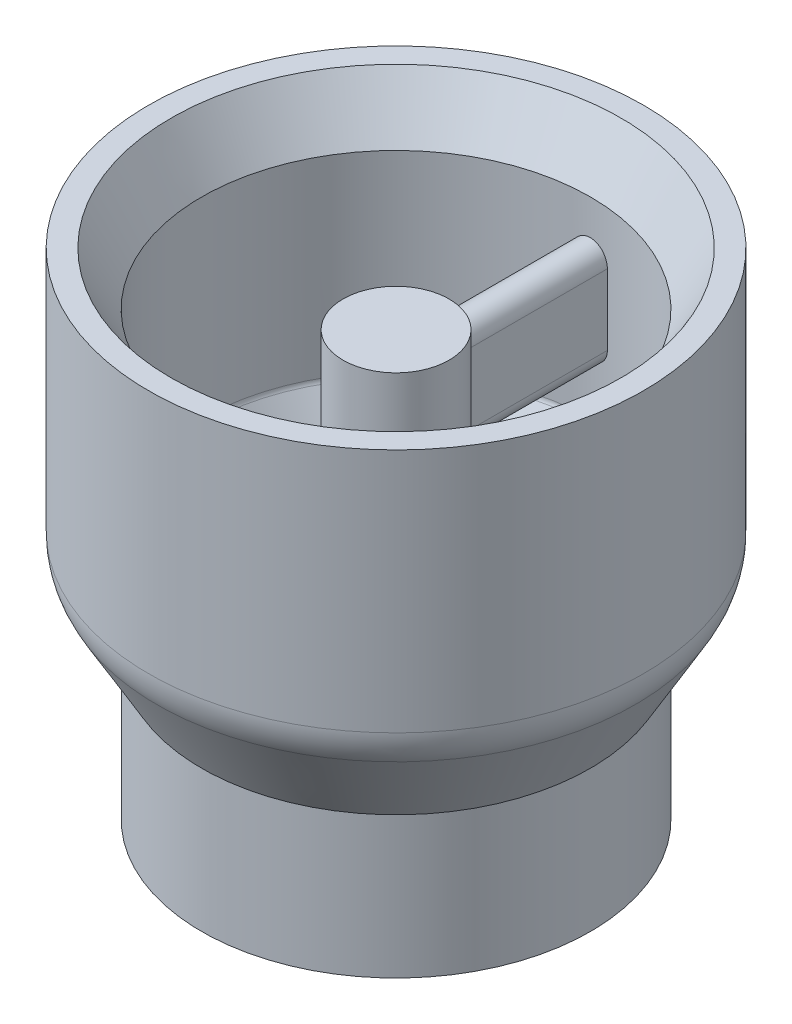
ISO-10303-21;
HEADER;
FILE_DESCRIPTION(('STEP AP214'),'2;1');
FILE_NAME('part.step','',(''),(''),'','','');
FILE_SCHEMA(('AUTOMOTIVE_DESIGN { 1 0 10303 214 1 1 1 1 }'));
ENDSEC;
DATA;
#1=APPLICATION_CONTEXT('core data for automotive mechanical design processes');
#2=APPLICATION_PROTOCOL_DEFINITION('international standard','automotive_design',2000,#1);
#3=PRODUCT_CONTEXT('',#1,'mechanical');
#4=PRODUCT('Part','Part','',(#3));
#5=PRODUCT_RELATED_PRODUCT_CATEGORY('part','',(#4));
#6=PRODUCT_DEFINITION_FORMATION('','',#4);
#7=PRODUCT_DEFINITION_CONTEXT('part definition',#1,'design');
#8=PRODUCT_DEFINITION('design','',#6,#7);
#9=PRODUCT_DEFINITION_SHAPE('','',#8);
#10=(LENGTH_UNIT() NAMED_UNIT(*) SI_UNIT(.MILLI.,.METRE.));
#11=(NAMED_UNIT(*) PLANE_ANGLE_UNIT() SI_UNIT($,.RADIAN.));
#12=(NAMED_UNIT(*) SI_UNIT($,.STERADIAN.) SOLID_ANGLE_UNIT());
#13=UNCERTAINTY_MEASURE_WITH_UNIT(LENGTH_MEASURE(1.E-05),#10,'distance_accuracy_value','');
#14=(GEOMETRIC_REPRESENTATION_CONTEXT(3) GLOBAL_UNCERTAINTY_ASSIGNED_CONTEXT((#13)) GLOBAL_UNIT_ASSIGNED_CONTEXT((#10,
#11,#12)) REPRESENTATION_CONTEXT('',''));
#15=CARTESIAN_POINT('',(0.,0.,0.));
#16=DIRECTION('',(0.,0.,1.));
#17=DIRECTION('',(1.,0.,0.));
#18=AXIS2_PLACEMENT_3D('',#15,#16,#17);
#19=CARTESIAN_POINT('',(0.,-31.75,-8.98025612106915));
#20=DIRECTION('',(0.,0.,-1.));
#21=DIRECTION('',(-1.,0.,0.));
#22=AXIS2_PLACEMENT_3D('',#19,#20,#21);
#23=CYLINDRICAL_SURFACE('',#22,3.175);
#24=DIRECTION('',(0.,0.,1.));
#25=VECTOR('',#24,1.);
#26=CARTESIAN_POINT('',(3.175,-31.75,-8.98025612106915));
#27=LINE('',#26,#25);
#28=CARTESIAN_POINT('',(3.175,-31.75,-8.98025612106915));
#29=VERTEX_POINT('',#28);
#30=CARTESIAN_POINT('',(3.175,-31.75,-34.780382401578));
#31=VERTEX_POINT('',#30);
#32=EDGE_CURVE('E94',#29,#31,#27,.F.);
#33=ORIENTED_EDGE('',*,*,#32,.F.);
#34=CARTESIAN_POINT('',(-3.175,-31.75,-8.98025612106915));
#35=CARTESIAN_POINT('',(-3.17501141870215,-31.8366229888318,-8.9802423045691));
#36=CARTESIAN_POINT('',(-3.17145526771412,-31.9232382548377,-8.98150913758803));
#37=CARTESIAN_POINT('',(-3.15729678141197,-32.0957969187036,-8.9865012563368));
#38=CARTESIAN_POINT('',(-3.14669634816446,-32.1817404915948,-8.99022587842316));
#39=CARTESIAN_POINT('',(-3.1185797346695,-32.3520949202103,-9.00001635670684));
#40=CARTESIAN_POINT('',(-3.10108406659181,-32.4365095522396,-9.0060752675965));
#41=CARTESIAN_POINT('',(-3.05935609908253,-32.6034505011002,-9.02033527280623));
#42=CARTESIAN_POINT('',(-3.03512355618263,-32.6859767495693,-9.0285364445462));
#43=CARTESIAN_POINT('',(-2.95264270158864,-32.9297812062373,-9.05598824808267));
#44=CARTESIAN_POINT('',(-2.88456899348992,-33.0875375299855,-9.07810279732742));
#45=CARTESIAN_POINT('',(-2.72437585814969,-33.3894135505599,-9.12745233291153));
#46=CARTESIAN_POINT('',(-2.63224166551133,-33.5335247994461,-9.15469046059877));
#47=CARTESIAN_POINT('',(-2.42269004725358,-33.8096769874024,-9.21240451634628));
#48=CARTESIAN_POINT('',(-2.30449481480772,-33.9411121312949,-9.24296080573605));
#49=CARTESIAN_POINT('',(-2.04783780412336,-34.1827067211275,-9.30318975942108));
#50=CARTESIAN_POINT('',(-1.90937242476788,-34.2928623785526,-9.33286226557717));
#51=CARTESIAN_POINT('',(-1.61164171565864,-34.4915467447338,-9.38891576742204));
#52=CARTESIAN_POINT('',(-1.45192782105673,-34.5794359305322,-9.41519063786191));
#53=CARTESIAN_POINT('',(-1.11896283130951,-34.7268555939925,-9.46053507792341));
#54=CARTESIAN_POINT('',(-0.945715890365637,-34.7863947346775,-9.47960684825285));
#55=CARTESIAN_POINT('',(-0.596993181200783,-34.8733608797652,-9.50782550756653));
#56=CARTESIAN_POINT('',(-0.421804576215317,-34.9018328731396,-9.5172945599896));
#57=CARTESIAN_POINT('',(-0.068894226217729,-34.9291792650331,-9.52638456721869));
#58=CARTESIAN_POINT('',(0.10882690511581,-34.9280607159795,-9.52600786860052));
#59=CARTESIAN_POINT('',(0.454354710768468,-34.8969193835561,-9.51566672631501));
#60=CARTESIAN_POINT('',(0.622276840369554,-34.8680320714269,-9.50607893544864));
#61=CARTESIAN_POINT('',(0.950734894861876,-34.7840516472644,-9.47886599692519));
#62=CARTESIAN_POINT('',(1.11127040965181,-34.7289570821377,-9.46124040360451));
#63=CARTESIAN_POINT('',(1.422884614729,-34.5934619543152,-9.41945246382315));
#64=CARTESIAN_POINT('',(1.5738111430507,-34.5127380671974,-9.39520718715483));
#65=CARTESIAN_POINT('',(1.86031043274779,-34.328545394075,-9.34270382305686));
#66=CARTESIAN_POINT('',(1.99587900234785,-34.225070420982,-9.31444464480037));
#67=CARTESIAN_POINT('',(2.25455959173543,-33.9925915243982,-9.25532407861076));
#68=CARTESIAN_POINT('',(2.37678676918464,-33.8626163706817,-9.22440281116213));
#69=CARTESIAN_POINT('',(2.59801162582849,-33.5837593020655,-9.16455803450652));
#70=CARTESIAN_POINT('',(2.69700180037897,-33.4348713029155,-9.13563517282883));
#71=CARTESIAN_POINT('',(2.87021834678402,-33.1193985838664,-9.08272269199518));
#72=CARTESIAN_POINT('',(2.94405757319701,-32.9525850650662,-9.05881220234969));
#73=CARTESIAN_POINT('',(3.0326733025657,-32.6943676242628,-9.02936653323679));
#74=CARTESIAN_POINT('',(3.05851877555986,-32.606978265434,-9.02062228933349));
#75=CARTESIAN_POINT('',(3.10263697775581,-32.4301163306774,-9.00554368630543));
#76=CARTESIAN_POINT('',(3.12091316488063,-32.3406447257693,-8.99920822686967));
#77=CARTESIAN_POINT('',(3.14850521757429,-32.1677947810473,-8.98959087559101));
#78=CARTESIAN_POINT('',(3.15843785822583,-32.0845255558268,-8.9860995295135));
#79=CARTESIAN_POINT('',(3.17168561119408,-31.9175071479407,-8.98142776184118));
#80=CARTESIAN_POINT('',(3.17500926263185,-31.8337587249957,-8.98024435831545));
#81=CARTESIAN_POINT('',(3.175,-31.75,-8.98025612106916));
#82=B_SPLINE_CURVE_WITH_KNOTS('',3,(#34,#35,#36,#37,#38,#39,#40,#41,#42,#43,#44,#45,#46,#47,#48,
#49,#50,#51,#52,#53,#54,#55,#56,#57,#58,#59,#60,#61,#62,#63,#64,#65,#66,#67,#68,#69,#70,#71,#72,
#73,#74,#75,#76,#77,#78,#79,#80,#81),.UNSPECIFIED.,.F.,.F.,(4,2,2,2,2,2,2,2,2,2,2,2,2,2,2,2,2,2,
2,2,2,2,2,4),(0.,0.259773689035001,0.519477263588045,0.778414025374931,1.03736014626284,
1.55449291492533,2.07194378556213,2.60766387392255,3.14347925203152,3.6932798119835,
4.24291225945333,4.77342553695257,5.30381237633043,5.81339512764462,6.3230061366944,
6.83932018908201,7.35577482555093,7.89650105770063,8.43740168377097,8.9862872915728,
9.26063415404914,9.53485554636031,9.78636405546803,10.0375473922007),.UNSPECIFIED.);
#83=CARTESIAN_POINT('',(-3.175,-31.75,-8.98025612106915));
#84=VERTEX_POINT('',#83);
#85=EDGE_CURVE('E44',#29,#84,#82,.F.);
#86=ORIENTED_EDGE('',*,*,#85,.T.);
#87=DIRECTION('',(0.,0.,1.));
#88=VECTOR('',#87,1.);
#89=CARTESIAN_POINT('',(-3.175,-31.75,-8.98025612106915));
#90=LINE('',#89,#88);
#91=CARTESIAN_POINT('',(-3.175,-31.75,-34.780382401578));
#92=VERTEX_POINT('',#91);
#93=EDGE_CURVE('E164',#92,#84,#90,.T.);
#94=ORIENTED_EDGE('',*,*,#93,.F.);
#95=CARTESIAN_POINT('',(3.175,-31.75,-34.780382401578));
#96=CARTESIAN_POINT('',(3.17500876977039,-31.8391036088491,-34.7803790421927));
#97=CARTESIAN_POINT('',(3.17124912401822,-31.9282029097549,-34.7807247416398));
#98=CARTESIAN_POINT('',(3.15626090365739,-32.1057604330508,-34.7820894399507));
#99=CARTESIAN_POINT('',(3.14503280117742,-32.1942186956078,-34.7831083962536));
#100=CARTESIAN_POINT('',(3.11518857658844,-32.3697964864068,-34.7857936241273));
#101=CARTESIAN_POINT('',(3.09657890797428,-32.4569171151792,-34.7874593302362));
#102=CARTESIAN_POINT('',(3.0521253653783,-32.6292530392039,-34.7913875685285));
#103=CARTESIAN_POINT('',(3.02628155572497,-32.7144683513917,-34.7936500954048));
#104=CARTESIAN_POINT('',(2.9381182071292,-32.9664209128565,-34.8012445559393));
#105=CARTESIAN_POINT('',(2.86515178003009,-33.1295523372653,-34.8073848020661));
#106=CARTESIAN_POINT('',(2.69302645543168,-33.4411405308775,-34.82112340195));
#107=CARTESIAN_POINT('',(2.59387105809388,-33.5895992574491,-34.8287215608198));
#108=CARTESIAN_POINT('',(2.37184165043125,-33.8682028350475,-34.8445458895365));
#109=CARTESIAN_POINT('',(2.24890666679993,-33.9982990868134,-34.8527736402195));
#110=CARTESIAN_POINT('',(1.98292934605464,-34.2360502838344,-34.8689164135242));
#111=CARTESIAN_POINT('',(1.83988395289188,-34.3437018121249,-34.8768313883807));
#112=CARTESIAN_POINT('',(1.53745383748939,-34.5336664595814,-34.8914715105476));
#113=CARTESIAN_POINT('',(1.37804170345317,-34.6159361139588,-34.8981946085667));
#114=CARTESIAN_POINT('',(1.04760474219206,-34.7525167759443,-34.9096755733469));
#115=CARTESIAN_POINT('',(0.876580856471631,-34.8068300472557,-34.914433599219));
#116=CARTESIAN_POINT('',(0.528267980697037,-34.8858188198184,-34.9214375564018));
#117=CARTESIAN_POINT('',(0.350997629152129,-34.9105758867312,-34.9236904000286));
#118=CARTESIAN_POINT('',(-0.00519988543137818,-34.9300016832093,-34.9254536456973));
#119=CARTESIAN_POINT('',(-0.184127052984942,-34.9246703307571,-34.9249640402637));
#120=CARTESIAN_POINT('',(-0.537995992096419,-34.8841360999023,-34.921303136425));
#121=CARTESIAN_POINT('',(-0.712948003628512,-34.8490217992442,-34.9181397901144));
#122=CARTESIAN_POINT('',(-1.0544639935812,-34.7500563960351,-34.9094962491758));
#123=CARTESIAN_POINT('',(-1.22102792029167,-34.686205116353,-34.9040160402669));
#124=CARTESIAN_POINT('',(-1.54132436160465,-34.5314788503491,-34.8913413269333));
#125=CARTESIAN_POINT('',(-1.69503744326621,-34.4405638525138,-34.8841442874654));
#126=CARTESIAN_POINT('',(-1.98504891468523,-34.2343240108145,-34.8688446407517));
#127=CARTESIAN_POINT('',(-2.12134767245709,-34.1189996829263,-34.8607420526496));
#128=CARTESIAN_POINT('',(-2.37316982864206,-33.8667346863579,-34.8445074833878));
#129=CARTESIAN_POINT('',(-2.48861913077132,-33.7297200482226,-34.8363754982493));
#130=CARTESIAN_POINT('',(-2.69492576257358,-33.4381624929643,-34.8210244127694));
#131=CARTESIAN_POINT('',(-2.78577555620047,-33.2836142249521,-34.8138055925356));
#132=CARTESIAN_POINT('',(-2.9402994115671,-32.9613020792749,-34.8010962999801));
#133=CARTESIAN_POINT('',(-3.00395292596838,-32.7935283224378,-34.7956071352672));
#134=CARTESIAN_POINT('',(-3.10207015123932,-32.4497394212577,-34.7869983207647));
#135=CARTESIAN_POINT('',(-3.13657808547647,-32.2737371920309,-34.7838750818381));
#136=CARTESIAN_POINT('',(-3.1623747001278,-32.0387614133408,-34.7815328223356));
#137=CARTESIAN_POINT('',(-3.16711156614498,-31.9810605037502,-34.7811016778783));
#138=CARTESIAN_POINT('',(-3.173419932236,-31.865581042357,-34.7805268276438));
#139=CARTESIAN_POINT('',(-3.17499670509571,-31.8078027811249,-34.7803826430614));
#140=CARTESIAN_POINT('',(-3.175,-31.75,-34.780382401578));
#141=B_SPLINE_CURVE_WITH_KNOTS('',3,(#95,#96,#97,#98,#99,#100,#101,#102,#103,#104,#105,#106,
#107,#108,#109,#110,#111,#112,#113,#114,#115,#116,#117,#118,#119,#120,#121,#122,#123,#124,#125,
#126,#127,#128,#129,#130,#131,#132,#133,#134,#135,#136,#137,#138,#139,#140),.UNSPECIFIED.,.F.,
.F.,(4,2,2,2,2,2,2,2,2,2,2,2,2,2,2,2,2,2,2,2,2,2,4),(0.,0.267223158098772,0.534429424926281,
0.801402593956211,1.0683733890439,1.60205183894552,2.1356589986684,2.67065296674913,
3.20572832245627,3.74171493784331,4.27765814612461,4.8121188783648,5.34658106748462,
5.8794592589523,6.41234073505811,6.94601397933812,7.47967594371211,8.01519867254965,
8.55088527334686,9.08697588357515,9.6222516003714,9.79587920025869,9.96921685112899),.UNSPECIFIED.);
#142=EDGE_CURVE('E11',#92,#31,#141,.F.);
#143=ORIENTED_EDGE('',*,*,#142,.T.);
#144=EDGE_LOOP('',(#33,#86,#94,#143));
#145=FACE_BOUND('',#144,.T.);
#146=ADVANCED_FACE('F32',(#145),#23,.T.);
#147=CARTESIAN_POINT('',(0.,-19.05,-34.780382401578));
#148=DIRECTION('',(0.,0.,-1.));
#149=DIRECTION('',(-1.,0.,0.));
#150=AXIS2_PLACEMENT_3D('',#147,#148,#149);
#151=CYLINDRICAL_SURFACE('',#150,3.175);
#152=DIRECTION('',(0.,0.,-1.));
#153=VECTOR('',#152,1.);
#154=CARTESIAN_POINT('',(3.175,-19.05,0.));
#155=LINE('',#154,#153);
#156=CARTESIAN_POINT('',(3.175,-19.05,-34.780382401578));
#157=VERTEX_POINT('',#156);
#158=CARTESIAN_POINT('',(3.175,-19.05,-8.98025612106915));
#159=VERTEX_POINT('',#158);
#160=EDGE_CURVE('E90',#157,#159,#155,.F.);
#161=ORIENTED_EDGE('',*,*,#160,.F.);
#162=CARTESIAN_POINT('',(-3.175,-19.05,-34.780382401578));
#163=CARTESIAN_POINT('',(-3.17500876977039,-18.9608963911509,-34.7803790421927));
#164=CARTESIAN_POINT('',(-3.17124912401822,-18.8717970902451,-34.7807247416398));
#165=CARTESIAN_POINT('',(-3.15626090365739,-18.6942395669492,-34.7820894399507));
#166=CARTESIAN_POINT('',(-3.14503280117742,-18.6057813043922,-34.7831083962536));
#167=CARTESIAN_POINT('',(-3.11518857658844,-18.4302035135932,-34.7857936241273));
#168=CARTESIAN_POINT('',(-3.09657890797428,-18.3430828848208,-34.7874593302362));
#169=CARTESIAN_POINT('',(-3.0521253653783,-18.170746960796,-34.7913875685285));
#170=CARTESIAN_POINT('',(-3.02628155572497,-18.0855316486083,-34.7936500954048));
#171=CARTESIAN_POINT('',(-2.9381182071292,-17.8335790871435,-34.8012445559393));
#172=CARTESIAN_POINT('',(-2.86515178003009,-17.6704476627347,-34.8073848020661));
#173=CARTESIAN_POINT('',(-2.69302645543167,-17.3588594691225,-34.82112340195));
#174=CARTESIAN_POINT('',(-2.59387105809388,-17.2104007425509,-34.8287215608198));
#175=CARTESIAN_POINT('',(-2.37184165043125,-16.9317971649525,-34.8445458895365));
#176=CARTESIAN_POINT('',(-2.24890666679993,-16.8017009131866,-34.8527736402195));
#177=CARTESIAN_POINT('',(-1.98292934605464,-16.5639497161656,-34.8689164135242));
#178=CARTESIAN_POINT('',(-1.83988395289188,-16.4562981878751,-34.8768313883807));
#179=CARTESIAN_POINT('',(-1.53745383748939,-16.2663335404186,-34.8914715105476));
#180=CARTESIAN_POINT('',(-1.37804170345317,-16.1840638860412,-34.8981946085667));
#181=CARTESIAN_POINT('',(-1.04760474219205,-16.0474832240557,-34.9096755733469));
#182=CARTESIAN_POINT('',(-0.876580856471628,-15.9931699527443,-34.914433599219));
#183=CARTESIAN_POINT('',(-0.528267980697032,-15.9141811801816,-34.9214375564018));
#184=CARTESIAN_POINT('',(-0.350997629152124,-15.8894241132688,-34.9236904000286));
#185=CARTESIAN_POINT('',(0.00519988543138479,-15.8699983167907,-34.9254536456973));
#186=CARTESIAN_POINT('',(0.184127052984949,-15.8753296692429,-34.9249640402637));
#187=CARTESIAN_POINT('',(0.537995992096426,-15.9158639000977,-34.921303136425));
#188=CARTESIAN_POINT('',(0.712948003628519,-15.9509782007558,-34.9181397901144));
#189=CARTESIAN_POINT('',(1.05446399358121,-16.0499436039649,-34.9094962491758));
#190=CARTESIAN_POINT('',(1.22102792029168,-16.113794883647,-34.9040160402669));
#191=CARTESIAN_POINT('',(1.54132436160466,-16.2685211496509,-34.8913413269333));
#192=CARTESIAN_POINT('',(1.69503744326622,-16.3594361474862,-34.8841442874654));
#193=CARTESIAN_POINT('',(1.98504891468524,-16.5656759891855,-34.8688446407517));
#194=CARTESIAN_POINT('',(2.1213476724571,-16.6810003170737,-34.8607420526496));
#195=CARTESIAN_POINT('',(2.37316982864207,-16.9332653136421,-34.8445074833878));
#196=CARTESIAN_POINT('',(2.48861913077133,-17.0702799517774,-34.8363754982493));
#197=CARTESIAN_POINT('',(2.69492576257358,-17.3618375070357,-34.8210244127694));
#198=CARTESIAN_POINT('',(2.78577555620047,-17.5163857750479,-34.8138055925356));
#199=CARTESIAN_POINT('',(2.94029941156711,-17.8386979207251,-34.8010962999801));
#200=CARTESIAN_POINT('',(3.00395292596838,-18.0064716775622,-34.7956071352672));
#201=CARTESIAN_POINT('',(3.10207015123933,-18.3502605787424,-34.7869983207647));
#202=CARTESIAN_POINT('',(3.13657808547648,-18.5262628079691,-34.7838750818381));
#203=CARTESIAN_POINT('',(3.16237470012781,-18.7612385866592,-34.7815328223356));
#204=CARTESIAN_POINT('',(3.16711156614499,-18.8189394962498,-34.7811016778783));
#205=CARTESIAN_POINT('',(3.17341993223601,-18.934418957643,-34.7805268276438));
#206=CARTESIAN_POINT('',(3.17499670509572,-18.9921972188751,-34.7803826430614));
#207=CARTESIAN_POINT('',(3.175,-19.05,-34.780382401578));
#208=B_SPLINE_CURVE_WITH_KNOTS('',3,(#162,#163,#164,#165,#166,#167,#168,#169,#170,#171,#172,
#173,#174,#175,#176,#177,#178,#179,#180,#181,#182,#183,#184,#185,#186,#187,#188,#189,#190,#191,
#192,#193,#194,#195,#196,#197,#198,#199,#200,#201,#202,#203,#204,#205,#206,#207),.UNSPECIFIED.,
.F.,.F.,(4,2,2,2,2,2,2,2,2,2,2,2,2,2,2,2,2,2,2,2,2,2,4),(0.,0.267223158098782,0.534429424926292,
0.801402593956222,1.0683733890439,1.60205183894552,2.1356589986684,2.67065296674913,
3.20572832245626,3.74171493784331,4.27765814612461,4.8121188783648,5.34658106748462,
5.87945925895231,6.41234073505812,6.94601397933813,7.47967594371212,8.01519867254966,
8.55088527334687,9.08697588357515,9.62225160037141,9.7958792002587,9.96921685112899),.UNSPECIFIED.);
#209=CARTESIAN_POINT('',(-3.175,-19.05,-34.780382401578));
#210=VERTEX_POINT('',#209);
#211=EDGE_CURVE('E95',#157,#210,#208,.F.);
#212=ORIENTED_EDGE('',*,*,#211,.T.);
#213=DIRECTION('',(0.,0.,-1.));
#214=VECTOR('',#213,1.);
#215=CARTESIAN_POINT('',(-3.175,-19.05,0.));
#216=LINE('',#215,#214);
#217=CARTESIAN_POINT('',(-3.175,-19.05,-8.98025612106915));
#218=VERTEX_POINT('',#217);
#219=EDGE_CURVE('E92',#218,#210,#216,.T.);
#220=ORIENTED_EDGE('',*,*,#219,.F.);
#221=CARTESIAN_POINT('',(3.175,-19.05,-8.98025612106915));
#222=CARTESIAN_POINT('',(3.17501141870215,-18.9633770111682,-8.9802423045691));
#223=CARTESIAN_POINT('',(3.17145526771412,-18.8767617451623,-8.98150913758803));
#224=CARTESIAN_POINT('',(3.15729678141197,-18.7042030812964,-8.9865012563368));
#225=CARTESIAN_POINT('',(3.14669634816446,-18.6182595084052,-8.99022587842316));
#226=CARTESIAN_POINT('',(3.1185797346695,-18.4479050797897,-9.00001635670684));
#227=CARTESIAN_POINT('',(3.10108406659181,-18.3634904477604,-9.00607526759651));
#228=CARTESIAN_POINT('',(3.05935609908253,-18.1965494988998,-9.02033527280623));
#229=CARTESIAN_POINT('',(3.03512355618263,-18.1140232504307,-9.0285364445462));
#230=CARTESIAN_POINT('',(2.95264270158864,-17.8702187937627,-9.05598824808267));
#231=CARTESIAN_POINT('',(2.88456899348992,-17.7124624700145,-9.07810279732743));
#232=CARTESIAN_POINT('',(2.72437585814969,-17.4105864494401,-9.12745233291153));
#233=CARTESIAN_POINT('',(2.63224166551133,-17.2664752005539,-9.15469046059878));
#234=CARTESIAN_POINT('',(2.42269004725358,-16.9903230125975,-9.21240451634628));
#235=CARTESIAN_POINT('',(2.30449481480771,-16.8588878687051,-9.24296080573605));
#236=CARTESIAN_POINT('',(2.04783780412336,-16.6172932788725,-9.30318975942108));
#237=CARTESIAN_POINT('',(1.90937242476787,-16.5071376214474,-9.33286226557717));
#238=CARTESIAN_POINT('',(1.61164171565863,-16.3084532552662,-9.38891576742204));
#239=CARTESIAN_POINT('',(1.45192782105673,-16.2205640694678,-9.41519063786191));
#240=CARTESIAN_POINT('',(1.11896283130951,-16.0731444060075,-9.46053507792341));
#241=CARTESIAN_POINT('',(0.945715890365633,-16.0136052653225,-9.47960684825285));
#242=CARTESIAN_POINT('',(0.596993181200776,-15.9266391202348,-9.50782550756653));
#243=CARTESIAN_POINT('',(0.42180457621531,-15.8981671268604,-9.5172945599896));
#244=CARTESIAN_POINT('',(0.0688942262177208,-15.8708207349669,-9.52638456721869));
#245=CARTESIAN_POINT('',(-0.108826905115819,-15.8719392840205,-9.52600786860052));
#246=CARTESIAN_POINT('',(-0.454354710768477,-15.9030806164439,-9.51566672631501));
#247=CARTESIAN_POINT('',(-0.622276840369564,-15.9319679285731,-9.50607893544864));
#248=CARTESIAN_POINT('',(-0.950734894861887,-16.0159483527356,-9.47886599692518));
#249=CARTESIAN_POINT('',(-1.11127040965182,-16.0710429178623,-9.4612404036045));
#250=CARTESIAN_POINT('',(-1.42288461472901,-16.2065380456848,-9.41945246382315));
#251=CARTESIAN_POINT('',(-1.57381114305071,-16.2872619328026,-9.39520718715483));
#252=CARTESIAN_POINT('',(-1.8603104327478,-16.471454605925,-9.34270382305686));
#253=CARTESIAN_POINT('',(-1.99587900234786,-16.574929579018,-9.31444464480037));
#254=CARTESIAN_POINT('',(-2.25455959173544,-16.8074084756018,-9.25532407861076));
#255=CARTESIAN_POINT('',(-2.37678676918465,-16.9373836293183,-9.22440281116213));
#256=CARTESIAN_POINT('',(-2.5980116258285,-17.2162406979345,-9.16455803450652));
#257=CARTESIAN_POINT('',(-2.69700180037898,-17.3651286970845,-9.13563517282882));
#258=CARTESIAN_POINT('',(-2.87021834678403,-17.6806014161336,-9.08272269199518));
#259=CARTESIAN_POINT('',(-2.94405757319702,-17.8474149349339,-9.05881220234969));
#260=CARTESIAN_POINT('',(-3.03267330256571,-18.1056323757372,-9.02936653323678));
#261=CARTESIAN_POINT('',(-3.05851877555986,-18.193021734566,-9.02062228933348));
#262=CARTESIAN_POINT('',(-3.10263697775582,-18.3698836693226,-9.00554368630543));
#263=CARTESIAN_POINT('',(-3.12091316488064,-18.4593552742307,-8.99920822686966));
#264=CARTESIAN_POINT('',(-3.1485052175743,-18.6322052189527,-8.98959087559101));
#265=CARTESIAN_POINT('',(-3.15843785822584,-18.7154744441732,-8.98609952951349));
#266=CARTESIAN_POINT('',(-3.17168561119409,-18.8824928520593,-8.98142776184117));
#267=CARTESIAN_POINT('',(-3.17500926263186,-18.9662412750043,-8.98024435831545));
#268=CARTESIAN_POINT('',(-3.17500000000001,-19.05,-8.98025612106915));
#269=B_SPLINE_CURVE_WITH_KNOTS('',3,(#221,#222,#223,#224,#225,#226,#227,#228,#229,#230,#231,
#232,#233,#234,#235,#236,#237,#238,#239,#240,#241,#242,#243,#244,#245,#246,#247,#248,#249,#250,
#251,#252,#253,#254,#255,#256,#257,#258,#259,#260,#261,#262,#263,#264,#265,#266,#267,#268),
.UNSPECIFIED.,.F.,.F.,(4,2,2,2,2,2,2,2,2,2,2,2,2,2,2,2,2,2,2,2,2,2,2,4),(0.,0.259773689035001,
0.519477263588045,0.778414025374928,1.03736014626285,1.55449291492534,2.07194378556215,
2.60766387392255,3.14347925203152,3.6932798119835,4.24291225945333,4.77342553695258,
5.30381237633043,5.81339512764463,6.32300613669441,6.83932018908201,7.35577482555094,
7.89650105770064,8.43740168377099,8.98628729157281,9.26063415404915,9.53485554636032,
9.78636405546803,10.0375473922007),.UNSPECIFIED.);
#270=EDGE_CURVE('E79',#218,#159,#269,.F.);
#271=ORIENTED_EDGE('',*,*,#270,.T.);
#272=EDGE_LOOP('',(#161,#212,#220,#271));
#273=FACE_BOUND('',#272,.T.);
#274=ADVANCED_FACE('F89',(#273),#151,.T.);
#275=CARTESIAN_POINT('',(0.,0.,0.));
#276=DIRECTION('',(0.,-1.,0.));
#277=DIRECTION('',(0.,0.,-1.));
#278=AXIS2_PLACEMENT_3D('',#275,#276,#277);
#279=CYLINDRICAL_SURFACE('',#278,34.925);
#280=ORIENTED_EDGE('',*,*,#142,.F.);
#281=DIRECTION('',(0.,-1.,0.));
#282=VECTOR('',#281,1.);
#283=CARTESIAN_POINT('',(-3.175,0.,-34.780382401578));
#284=LINE('',#283,#282);
#285=EDGE_CURVE('E100',#210,#92,#284,.T.);
#286=ORIENTED_EDGE('',*,*,#285,.F.);
#287=ORIENTED_EDGE('',*,*,#211,.F.);
#288=DIRECTION('',(0.,-1.,0.));
#289=VECTOR('',#288,1.);
#290=CARTESIAN_POINT('',(3.175,0.,-34.780382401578));
#291=LINE('',#290,#289);
#292=EDGE_CURVE('E98',#31,#157,#291,.F.);
#293=ORIENTED_EDGE('',*,*,#292,.F.);
#294=EDGE_LOOP('',(#280,#286,#287,#293));
#295=FACE_BOUND('',#294,.T.);
#296=CARTESIAN_POINT('',(0.,-44.0246306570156,0.));
#297=DIRECTION('',(0.,-1.,0.));
#298=DIRECTION('',(0.,0.,-1.));
#299=AXIS2_PLACEMENT_3D('',#296,#297,#298);
#300=CIRCLE('',#299,34.925);
#301=CARTESIAN_POINT('',(0.,-44.0246306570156,-34.925));
#302=VERTEX_POINT('',#301);
#303=EDGE_CURVE('E199',#302,#302,#300,.T.);
#304=ORIENTED_EDGE('',*,*,#303,.T.);
#305=EDGE_LOOP('',(#304));
#306=FACE_BOUND('',#305,.T.);
#307=CARTESIAN_POINT('',(0.,-9.52500000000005,0.));
#308=DIRECTION('',(0.,1.,0.));
#309=DIRECTION('',(0.,0.,1.));
#310=AXIS2_PLACEMENT_3D('',#307,#308,#309);
#311=CIRCLE('',#310,34.925);
#312=CARTESIAN_POINT('',(0.,-9.52500000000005,34.925));
#313=VERTEX_POINT('',#312);
#314=EDGE_CURVE('E222',#313,#313,#311,.T.);
#315=ORIENTED_EDGE('',*,*,#314,.T.);
#316=EDGE_LOOP('',(#315));
#317=FACE_BOUND('',#316,.T.);
#318=ADVANCED_FACE('F117',(#295,#306,#317),#279,.F.);
#319=CARTESIAN_POINT('',(0.,0.,0.));
#320=DIRECTION('',(0.,-1.,0.));
#321=DIRECTION('',(0.,0.,-1.));
#322=AXIS2_PLACEMENT_3D('',#319,#320,#321);
#323=CYLINDRICAL_SURFACE('',#322,34.925);
#324=CARTESIAN_POINT('',(0.,-88.9,0.));
#325=DIRECTION('',(0.,-1.,0.));
#326=DIRECTION('',(0.,0.,-1.));
#327=AXIS2_PLACEMENT_3D('',#324,#325,#326);
#328=CIRCLE('',#327,34.925);
#329=CARTESIAN_POINT('',(0.,-88.9,-34.925));
#330=VERTEX_POINT('',#329);
#331=EDGE_CURVE('E240',#330,#330,#328,.T.);
#332=ORIENTED_EDGE('',*,*,#331,.F.);
#333=EDGE_LOOP('',(#332));
#334=FACE_BOUND('',#333,.T.);
#335=CARTESIAN_POINT('',(0.,-63.4999999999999,0.));
#336=DIRECTION('',(0.,-1.,0.));
#337=DIRECTION('',(0.,0.,-1.));
#338=AXIS2_PLACEMENT_3D('',#335,#336,#337);
#339=CIRCLE('',#338,34.925);
#340=CARTESIAN_POINT('',(0.,-63.4999999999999,-34.925));
#341=VERTEX_POINT('',#340);
#342=EDGE_CURVE('E216',#341,#341,#339,.T.);
#343=ORIENTED_EDGE('',*,*,#342,.T.);
#344=EDGE_LOOP('',(#343));
#345=FACE_BOUND('',#344,.T.);
#346=ADVANCED_FACE('F122',(#334,#345),#323,.T.);
#347=CARTESIAN_POINT('',(0.,-49.5808806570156,0.));
#348=DIRECTION('',(0.,1.,0.));
#349=DIRECTION('',(0.,0.,1.));
#350=AXIS2_PLACEMENT_3D('',#347,#348,#349);
#351=CONICAL_SURFACE('',#350,42.9612072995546,0.523598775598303);
#352=ORIENTED_EDGE('',*,*,#342,.F.);
#353=EDGE_LOOP('',(#352));
#354=FACE_BOUND('',#353,.T.);
#355=CARTESIAN_POINT('',(0.,-49.5808806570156,0.));
#356=DIRECTION('',(0.,-1.,0.));
#357=DIRECTION('',(0.,0.,-1.));
#358=AXIS2_PLACEMENT_3D('',#355,#356,#357);
#359=CIRCLE('',#358,42.9612072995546);
#360=CARTESIAN_POINT('',(0.,-49.5808806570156,-42.9612072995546));
#361=VERTEX_POINT('',#360);
#362=EDGE_CURVE('E213',#361,#361,#359,.T.);
#363=ORIENTED_EDGE('',*,*,#362,.T.);
#364=EDGE_LOOP('',(#363));
#365=FACE_BOUND('',#364,.T.);
#366=ADVANCED_FACE('F137',(#354,#365),#351,.T.);
#367=CARTESIAN_POINT('',(0.,-44.0246306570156,0.));
#368=DIRECTION('',(0.,-1.,0.));
#369=DIRECTION('',(0.,0.,-1.));
#370=AXIS2_PLACEMENT_3D('',#367,#368,#369);
#371=TOROIDAL_SURFACE('',#370,33.3375,11.1125);
#372=ORIENTED_EDGE('',*,*,#362,.F.);
#373=EDGE_LOOP('',(#372));
#374=FACE_BOUND('',#373,.T.);
#375=CARTESIAN_POINT('',(0.,-44.0246306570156,0.));
#376=DIRECTION('',(0.,-1.,0.));
#377=DIRECTION('',(0.,0.,-1.));
#378=AXIS2_PLACEMENT_3D('',#375,#376,#377);
#379=CIRCLE('',#378,44.45);
#380=CARTESIAN_POINT('',(0.,-44.0246306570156,-44.45));
#381=VERTEX_POINT('',#380);
#382=EDGE_CURVE('E210',#381,#381,#379,.T.);
#383=ORIENTED_EDGE('',*,*,#382,.T.);
#384=EDGE_LOOP('',(#383));
#385=FACE_BOUND('',#384,.T.);
#386=ADVANCED_FACE('F133',(#374,#385),#371,.T.);
#387=CARTESIAN_POINT('',(0.,0.,0.));
#388=DIRECTION('',(0.,-1.,0.));
#389=DIRECTION('',(0.,0.,-1.));
#390=AXIS2_PLACEMENT_3D('',#387,#388,#389);
#391=CYLINDRICAL_SURFACE('',#390,44.45);
#392=CARTESIAN_POINT('',(0.,0.,0.));
#393=DIRECTION('',(0.,-1.,0.));
#394=DIRECTION('',(0.,0.,-1.));
#395=AXIS2_PLACEMENT_3D('',#392,#393,#394);
#396=CIRCLE('',#395,44.45);
#397=CARTESIAN_POINT('',(0.,0.,-44.45));
#398=VERTEX_POINT('',#397);
#399=EDGE_CURVE('E202',#398,#398,#396,.T.);
#400=ORIENTED_EDGE('',*,*,#399,.T.);
#401=EDGE_LOOP('',(#400));
#402=FACE_BOUND('',#401,.T.);
#403=ORIENTED_EDGE('',*,*,#382,.F.);
#404=EDGE_LOOP('',(#403));
#405=FACE_BOUND('',#404,.T.);
#406=ADVANCED_FACE('F129',(#402,#405),#391,.T.);
#407=CARTESIAN_POINT('',(-44.45,0.,0.));
#408=DIRECTION('',(0.,1.,0.));
#409=DIRECTION('',(0.,0.,1.));
#410=AXIS2_PLACEMENT_3D('',#407,#408,#409);
#411=PLANE('',#410);
#412=CARTESIAN_POINT('',(0.,0.,0.));
#413=DIRECTION('',(0.,1.,0.));
#414=DIRECTION('',(0.,0.,1.));
#415=AXIS2_PLACEMENT_3D('',#412,#413,#414);
#416=CIRCLE('',#415,40.4242613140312);
#417=CARTESIAN_POINT('',(0.,0.,40.4242613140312));
#418=VERTEX_POINT('',#417);
#419=EDGE_CURVE('E219',#418,#418,#416,.F.);
#420=ORIENTED_EDGE('',*,*,#419,.T.);
#421=EDGE_LOOP('',(#420));
#422=FACE_BOUND('',#421,.T.);
#423=ORIENTED_EDGE('',*,*,#399,.F.);
#424=EDGE_LOOP('',(#423));
#425=FACE_BOUND('',#424,.T.);
#426=ADVANCED_FACE('F125',(#422,#425),#411,.T.);
#427=CARTESIAN_POINT('',(0.,-44.0246306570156,0.));
#428=DIRECTION('',(0.,-1.,0.));
#429=DIRECTION('',(0.,0.,-1.));
#430=AXIS2_PLACEMENT_3D('',#427,#428,#429);
#431=TOROIDAL_SURFACE('',#430,33.3375,1.58750000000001);
#432=CARTESIAN_POINT('',(0.,-44.8183806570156,0.));
#433=DIRECTION('',(0.,-1.,0.));
#434=DIRECTION('',(0.,0.,-1.));
#435=AXIS2_PLACEMENT_3D('',#432,#433,#434);
#436=CIRCLE('',#435,34.7123153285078);
#437=CARTESIAN_POINT('',(0.,-44.8183806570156,-34.7123153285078));
#438=VERTEX_POINT('',#437);
#439=EDGE_CURVE('E198',#438,#438,#436,.T.);
#440=ORIENTED_EDGE('',*,*,#439,.T.);
#441=EDGE_LOOP('',(#440));
#442=FACE_BOUND('',#441,.T.);
#443=ORIENTED_EDGE('',*,*,#303,.F.);
#444=EDGE_LOOP('',(#443));
#445=FACE_BOUND('',#444,.T.);
#446=ADVANCED_FACE('F123',(#442,#445),#431,.F.);
#447=CARTESIAN_POINT('',(0.,-44.8183806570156,0.));
#448=DIRECTION('',(0.,1.,0.));
#449=DIRECTION('',(0.,0.,1.));
#450=AXIS2_PLACEMENT_3D('',#447,#448,#449);
#451=CONICAL_SURFACE('',#450,34.7123153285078,0.523598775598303);
#452=CARTESIAN_POINT('',(0.,-60.5794032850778,0.));
#453=DIRECTION('',(0.,-1.,0.));
#454=DIRECTION('',(0.,0.,-1.));
#455=AXIS2_PLACEMENT_3D('',#452,#453,#454);
#456=CIRCLE('',#455,25.6126846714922);
#457=CARTESIAN_POINT('',(0.,-60.5794032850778,-25.6126846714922));
#458=VERTEX_POINT('',#457);
#459=EDGE_CURVE('E195',#458,#458,#456,.T.);
#460=ORIENTED_EDGE('',*,*,#459,.T.);
#461=EDGE_LOOP('',(#460));
#462=FACE_BOUND('',#461,.T.);
#463=ORIENTED_EDGE('',*,*,#439,.F.);
#464=EDGE_LOOP('',(#463));
#465=FACE_BOUND('',#464,.T.);
#466=ADVANCED_FACE('F184',(#462,#465),#451,.F.);
#467=CARTESIAN_POINT('',(0.,-61.3731532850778,0.));
#468=DIRECTION('',(0.,-1.,0.));
#469=DIRECTION('',(0.,0.,-1.));
#470=AXIS2_PLACEMENT_3D('',#467,#468,#469);
#471=TOROIDAL_SURFACE('',#470,26.9875,1.5875);
#472=CARTESIAN_POINT('',(0.,-61.3731532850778,0.));
#473=DIRECTION('',(0.,-1.,0.));
#474=DIRECTION('',(0.,0.,-1.));
#475=AXIS2_PLACEMENT_3D('',#472,#473,#474);
#476=CIRCLE('',#475,25.4);
#477=CARTESIAN_POINT('',(0.,-61.3731532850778,-25.4));
#478=VERTEX_POINT('',#477);
#479=EDGE_CURVE('E204',#478,#478,#476,.T.);
#480=ORIENTED_EDGE('',*,*,#479,.T.);
#481=EDGE_LOOP('',(#480));
#482=FACE_BOUND('',#481,.T.);
#483=ORIENTED_EDGE('',*,*,#459,.F.);
#484=EDGE_LOOP('',(#483));
#485=FACE_BOUND('',#484,.T.);
#486=ADVANCED_FACE('F181',(#482,#485),#471,.T.);
#487=CARTESIAN_POINT('',(0.,0.,0.));
#488=DIRECTION('',(0.,-1.,0.));
#489=DIRECTION('',(0.,0.,-1.));
#490=AXIS2_PLACEMENT_3D('',#487,#488,#489);
#491=CYLINDRICAL_SURFACE('',#490,25.4);
#492=CARTESIAN_POINT('',(0.,-88.9,0.));
#493=DIRECTION('',(0.,-1.,0.));
#494=DIRECTION('',(0.,0.,-1.));
#495=AXIS2_PLACEMENT_3D('',#492,#493,#494);
#496=CIRCLE('',#495,25.4);
#497=CARTESIAN_POINT('',(0.,-88.9,-25.4));
#498=VERTEX_POINT('',#497);
#499=EDGE_CURVE('E237',#498,#498,#496,.T.);
#500=ORIENTED_EDGE('',*,*,#499,.T.);
#501=EDGE_LOOP('',(#500));
#502=FACE_BOUND('',#501,.T.);
#503=ORIENTED_EDGE('',*,*,#479,.F.);
#504=EDGE_LOOP('',(#503));
#505=FACE_BOUND('',#504,.T.);
#506=ADVANCED_FACE('F155',(#502,#505),#491,.F.);
#507=CARTESIAN_POINT('',(-25.4,-88.9,0.));
#508=DIRECTION('',(0.,-1.,0.));
#509=DIRECTION('',(0.,0.,-1.));
#510=AXIS2_PLACEMENT_3D('',#507,#508,#509);
#511=PLANE('',#510);
#512=ORIENTED_EDGE('',*,*,#331,.T.);
#513=EDGE_LOOP('',(#512));
#514=FACE_BOUND('',#513,.T.);
#515=ORIENTED_EDGE('',*,*,#499,.F.);
#516=EDGE_LOOP('',(#515));
#517=FACE_BOUND('',#516,.T.);
#518=ADVANCED_FACE('F147',(#514,#517),#511,.T.);
#519=CARTESIAN_POINT('',(0.,0.,0.));
#520=DIRECTION('',(0.,1.,0.));
#521=DIRECTION('',(0.,0.,1.));
#522=AXIS2_PLACEMENT_3D('',#519,#520,#521);
#523=CONICAL_SURFACE('',#522,40.4242613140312,0.523598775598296);
#524=ORIENTED_EDGE('',*,*,#314,.F.);
#525=EDGE_LOOP('',(#524));
#526=FACE_BOUND('',#525,.T.);
#527=ORIENTED_EDGE('',*,*,#419,.F.);
#528=EDGE_LOOP('',(#527));
#529=FACE_BOUND('',#528,.T.);
#530=ADVANCED_FACE('F144',(#526,#529),#523,.F.);
#531=CARTESIAN_POINT('',(-3.175,-34.925,0.));
#532=DIRECTION('',(-1.,0.,0.));
#533=DIRECTION('',(0.,0.,1.));
#534=AXIS2_PLACEMENT_3D('',#531,#532,#533);
#535=PLANE('',#534);
#536=ORIENTED_EDGE('',*,*,#285,.T.);
#537=ORIENTED_EDGE('',*,*,#93,.T.);
#538=DIRECTION('',(0.,1.,0.));
#539=VECTOR('',#538,1.);
#540=CARTESIAN_POINT('',(-3.175,-38.1,-8.98025612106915));
#541=LINE('',#540,#539);
#542=EDGE_CURVE('E84',#218,#84,#541,.F.);
#543=ORIENTED_EDGE('',*,*,#542,.F.);
#544=ORIENTED_EDGE('',*,*,#219,.T.);
#545=EDGE_LOOP('',(#536,#537,#543,#544));
#546=FACE_BOUND('',#545,.T.);
#547=ADVANCED_FACE('F146',(#546),#535,.T.);
#548=CARTESIAN_POINT('',(3.175,-34.925,0.));
#549=DIRECTION('',(1.,0.,0.));
#550=DIRECTION('',(0.,0.,-1.));
#551=AXIS2_PLACEMENT_3D('',#548,#549,#550);
#552=PLANE('',#551);
#553=DIRECTION('',(0.,1.,0.));
#554=VECTOR('',#553,1.);
#555=CARTESIAN_POINT('',(3.175,-38.1,-8.98025612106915));
#556=LINE('',#555,#554);
#557=EDGE_CURVE('E74',#29,#159,#556,.T.);
#558=ORIENTED_EDGE('',*,*,#557,.F.);
#559=ORIENTED_EDGE('',*,*,#32,.T.);
#560=ORIENTED_EDGE('',*,*,#292,.T.);
#561=ORIENTED_EDGE('',*,*,#160,.T.);
#562=EDGE_LOOP('',(#558,#559,#560,#561));
#563=FACE_BOUND('',#562,.T.);
#564=ADVANCED_FACE('F97',(#563),#552,.T.);
#565=CARTESIAN_POINT('',(0.,-38.1,0.));
#566=DIRECTION('',(0.,1.,0.));
#567=DIRECTION('',(0.,0.,1.));
#568=AXIS2_PLACEMENT_3D('',#565,#566,#567);
#569=CYLINDRICAL_SURFACE('',#568,9.525);
#570=ORIENTED_EDGE('',*,*,#85,.F.);
#571=ORIENTED_EDGE('',*,*,#557,.T.);
#572=ORIENTED_EDGE('',*,*,#270,.F.);
#573=ORIENTED_EDGE('',*,*,#542,.T.);
#574=EDGE_LOOP('',(#570,#571,#572,#573));
#575=FACE_BOUND('',#574,.T.);
#576=CARTESIAN_POINT('',(0.,-12.7,0.));
#577=DIRECTION('',(0.,1.,0.));
#578=DIRECTION('',(0.,0.,1.));
#579=AXIS2_PLACEMENT_3D('',#576,#577,#578);
#580=CIRCLE('',#579,9.525);
#581=CARTESIAN_POINT('',(0.,-12.7,9.525));
#582=VERTEX_POINT('',#581);
#583=EDGE_CURVE('E244',#582,#582,#580,.T.);
#584=ORIENTED_EDGE('',*,*,#583,.F.);
#585=EDGE_LOOP('',(#584));
#586=FACE_BOUND('',#585,.T.);
#587=CARTESIAN_POINT('',(0.,-38.1,0.));
#588=DIRECTION('',(0.,1.,0.));
#589=DIRECTION('',(0.,0.,1.));
#590=AXIS2_PLACEMENT_3D('',#587,#588,#589);
#591=CIRCLE('',#590,9.525);
#592=CARTESIAN_POINT('',(0.,-38.1,9.525));
#593=VERTEX_POINT('',#592);
#594=EDGE_CURVE('E85',#593,#593,#591,.T.);
#595=ORIENTED_EDGE('',*,*,#594,.T.);
#596=EDGE_LOOP('',(#595));
#597=FACE_BOUND('',#596,.T.);
#598=ADVANCED_FACE('F76',(#575,#586,#597),#569,.T.);
#599=CARTESIAN_POINT('',(0.,-38.1,0.));
#600=DIRECTION('',(0.,1.,0.));
#601=DIRECTION('',(0.,0.,1.));
#602=AXIS2_PLACEMENT_3D('',#599,#600,#601);
#603=PLANE('',#602);
#604=ORIENTED_EDGE('',*,*,#594,.F.);
#605=EDGE_LOOP('',(#604));
#606=FACE_BOUND('',#605,.T.);
#607=ADVANCED_FACE('F172',(#606),#603,.F.);
#608=CARTESIAN_POINT('',(0.,-12.7,0.));
#609=DIRECTION('',(0.,1.,0.));
#610=DIRECTION('',(0.,0.,1.));
#611=AXIS2_PLACEMENT_3D('',#608,#609,#610);
#612=PLANE('',#611);
#613=ORIENTED_EDGE('',*,*,#583,.T.);
#614=EDGE_LOOP('',(#613));
#615=FACE_BOUND('',#614,.T.);
#616=ADVANCED_FACE('F173',(#615),#612,.T.);
#617=CLOSED_SHELL('',(#146,#274,#318,#346,#366,#386,#406,#426,#446,#466,#486,#506,#518,#530,
#547,#564,#598,#607,#616));
#618=MANIFOLD_SOLID_BREP('B2',#617);
#619=ADVANCED_BREP_SHAPE_REPRESENTATION('',(#18,#618),#14);
#620=SHAPE_DEFINITION_REPRESENTATION(#9,#619);
ENDSEC;
END-ISO-10303-21;
